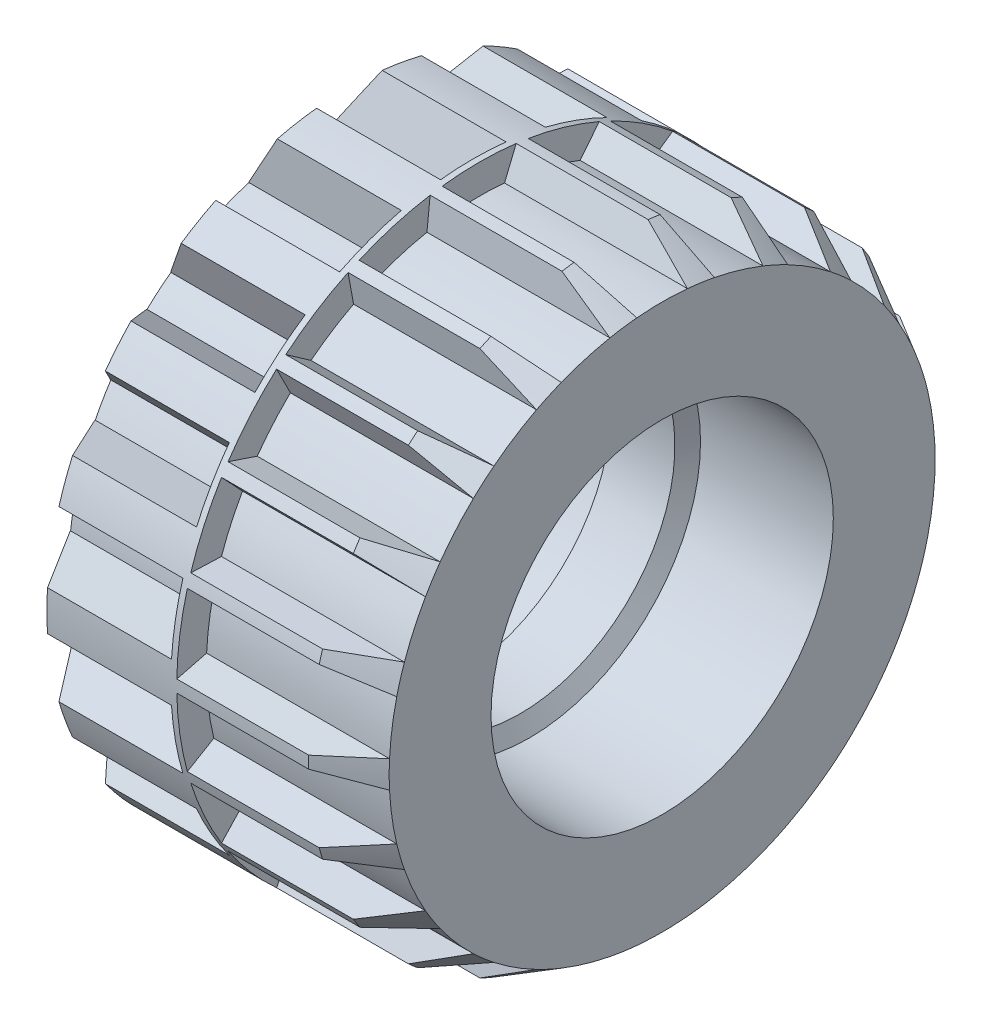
from build123d import *
from OCP.BRepFilletAPI import BRepFilletAPI_MakeChamfer

# Parameters (mm, degrees)
FASE1_SIZE                      = 1
FASE1_SIZE2                     = 1.732050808
SCHNITT_LINEAR_AUSTRAGEN3_DEPTH = 5.2
KREISMUSTER1_COUNT              = 18
SCHNITT_LINEAR_AUSTRAGEN4_DEPTH = 6.2
KREISMUSTER2_COUNT              = 22


with BuildPart() as part:
    # Skizze1 → Rotation1 (revolve)
    with BuildSketch(Plane.XY, mode=Mode.PRIVATE) as rotation1_sk:
        Polygon((14.132974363, 5.8), (18.432974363, 5.8), (18.750517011, 5.25), (20.915431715, 5.25), (21.232974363, 5.8), (25.732974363, 5.8), (25.732974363, 10.25), (14.132974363, 10.25), align=None)
    revolve(rotation1_sk.sketch.rotate(Axis((0, 0, 0), (1, 0, 0)), 90), axis=Axis((0, 0, 0), (1, 0, 0)))

    # Fase1: one chamfer whose edges measure the first distance from different faces: ONE call of the kernel's chamfer builder (chamfer() names one face for all edges)
    fase1_edges_1 = [part.edges().sort_by_distance(p)[0] for p in [
        (14.132974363, 0, -10.25),
    ]]
    fase1_side_1 = [part.faces().sort_by_distance(p)[0] for p in [
        (19.932974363, 0, -10.25),
    ]]
    fase1_edges_2 = [part.edges().sort_by_distance(p)[0] for p in [
        (25.732974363, 0, -10.25),
    ]]
    fase1_side_2 = [part.faces().sort_by_distance(p)[0] for p in [
        (25.732974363, 0, -6.08991378),
    ]]
    fase1 = BRepFilletAPI_MakeChamfer(part.part.solid().wrapped)
    for e in fase1_edges_1:
        fase1.Add(FASE1_SIZE, FASE1_SIZE2, e.wrapped, fase1_side_1[0].wrapped)  # the first distance lies on this face
    for e in fase1_edges_2:
        fase1.Add(FASE1_SIZE, FASE1_SIZE2, e.wrapped, fase1_side_2[0].wrapped)  # the first distance lies on this face
    add(Compound.cast(fase1.Shape()), mode=Mode.REPLACE)

    # Skizze2 → Schnitt-Linear austragen3 (cut)
    with BuildSketch(Plane.ZY.offset(-14.132974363)):
        with BuildLine():
            Line((-1.28765611, 10.707836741), (-0.529101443, 8.483516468))
            ThreePointArc((-0.529101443, 8.483516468), (0, 8.5), (0.529101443, 8.483516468))
            Line((0.529101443, 8.483516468), (1.28765611, 10.707836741))
            ThreePointArc((1.28765611, 10.707836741), (0, 10.784981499), (-1.28765611, 10.707836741))
        make_face()
    schnitt_linear_austragen3 = extrude(amount=-SCHNITT_LINEAR_AUSTRAGEN3_DEPTH, mode=Mode.SUBTRACT)

    # Kreismuster1: Schnitt-Linear austragen3 ×18 about axis
    kreismuster1_axis = Axis((0, 0, 0), (1, 0, 0))
    for i in range(1, KREISMUSTER1_COUNT):
        add(schnitt_linear_austragen3.rotate(kreismuster1_axis, i * 360 / KREISMUSTER1_COUNT), mode=Mode.SUBTRACT)

    # Skizze4 → Schnitt-Linear austragen4 (cut)
    with BuildSketch(Plane(origin=(25.732974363, 0, 0), x_dir=(0, 0, -1), z_dir=(1, 0, 0))):
        with BuildLine():
            Line((-1.426831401, 10.592974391), (-0.858189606, 9.210103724))
            ThreePointArc((-0.858189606, 9.210103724), (0, 9.25), (0.858189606, 9.210103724))
            Line((0.858189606, 9.210103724), (1.426831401, 10.592974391))
            ThreePointArc((1.426831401, 10.592974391), (0, 10.688636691), (-1.426831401, 10.592974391))
        make_face()
    schnitt_linear_austragen4 = extrude(amount=-SCHNITT_LINEAR_AUSTRAGEN4_DEPTH, mode=Mode.SUBTRACT)

    # Kreismuster2: Schnitt-Linear austragen4 ×22 about axis
    kreismuster2_axis = Axis((0, 0, 0), (1, 0, 0))
    for i in range(1, KREISMUSTER2_COUNT):
        add(schnitt_linear_austragen4.rotate(kreismuster2_axis, i * 360 / KREISMUSTER2_COUNT), mode=Mode.SUBTRACT)


solid = part.part
